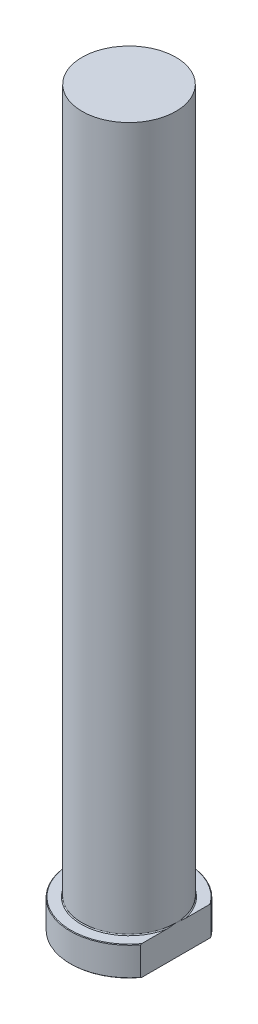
ISO-10303-21;
HEADER;
FILE_DESCRIPTION(('STEP AP214'),'2;1');
FILE_NAME('part.step','',(''),(''),'','','');
FILE_SCHEMA(('AUTOMOTIVE_DESIGN { 1 0 10303 214 1 1 1 1 }'));
ENDSEC;
DATA;
#1=APPLICATION_CONTEXT('core data for automotive mechanical design processes');
#2=APPLICATION_PROTOCOL_DEFINITION('international standard','automotive_design',2000,#1);
#3=PRODUCT_CONTEXT('',#1,'mechanical');
#4=PRODUCT('Part','Part','',(#3));
#5=PRODUCT_RELATED_PRODUCT_CATEGORY('part','',(#4));
#6=PRODUCT_DEFINITION_FORMATION('','',#4);
#7=PRODUCT_DEFINITION_CONTEXT('part definition',#1,'design');
#8=PRODUCT_DEFINITION('design','',#6,#7);
#9=PRODUCT_DEFINITION_SHAPE('','',#8);
#10=(LENGTH_UNIT() NAMED_UNIT(*) SI_UNIT(.MILLI.,.METRE.));
#11=(NAMED_UNIT(*) PLANE_ANGLE_UNIT() SI_UNIT($,.RADIAN.));
#12=(NAMED_UNIT(*) SI_UNIT($,.STERADIAN.) SOLID_ANGLE_UNIT());
#13=UNCERTAINTY_MEASURE_WITH_UNIT(LENGTH_MEASURE(1.E-05),#10,'distance_accuracy_value','');
#14=(GEOMETRIC_REPRESENTATION_CONTEXT(3) GLOBAL_UNCERTAINTY_ASSIGNED_CONTEXT((#13)) GLOBAL_UNIT_ASSIGNED_CONTEXT((#10,
#11,#12)) REPRESENTATION_CONTEXT('',''));
#15=CARTESIAN_POINT('',(0.,0.,0.));
#16=DIRECTION('',(0.,0.,1.));
#17=DIRECTION('',(1.,0.,0.));
#18=AXIS2_PLACEMENT_3D('',#15,#16,#17);
#19=CARTESIAN_POINT('',(0.,0.,0.));
#20=DIRECTION('',(0.,-1.,0.));
#21=DIRECTION('',(0.,0.,-1.));
#22=AXIS2_PLACEMENT_3D('',#19,#20,#21);
#23=PLANE('',#22);
#24=CARTESIAN_POINT('',(0.,0.,0.));
#25=DIRECTION('',(0.,-1.,0.));
#26=DIRECTION('',(0.,0.,-1.));
#27=AXIS2_PLACEMENT_3D('',#24,#25,#26);
#28=CIRCLE('',#27,19.7999999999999);
#29=CARTESIAN_POINT('',(16.,0.,11.6636186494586));
#30=VERTEX_POINT('',#29);
#31=CARTESIAN_POINT('',(16.,0.,-11.6636186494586));
#32=VERTEX_POINT('',#31);
#33=EDGE_CURVE('E98',#30,#32,#28,.T.);
#34=ORIENTED_EDGE('',*,*,#33,.T.);
#35=DIRECTION('',(0.,0.,1.));
#36=VECTOR('',#35,1.);
#37=CARTESIAN_POINT('',(16.,0.,-12.));
#38=LINE('',#37,#36);
#39=EDGE_CURVE('E83',#32,#30,#38,.T.);
#40=ORIENTED_EDGE('',*,*,#39,.T.);
#41=EDGE_LOOP('',(#34,#40));
#42=FACE_BOUND('',#41,.T.);
#43=ADVANCED_FACE('F32',(#42),#23,.T.);
#44=CARTESIAN_POINT('',(0.,259.958771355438,0.));
#45=DIRECTION('',(0.,1.,0.));
#46=DIRECTION('',(0.,0.,1.));
#47=AXIS2_PLACEMENT_3D('',#44,#45,#46);
#48=CYLINDRICAL_SURFACE('',#47,20.);
#49=CARTESIAN_POINT('',(0.,9.79999999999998,0.));
#50=DIRECTION('',(0.,1.,0.));
#51=DIRECTION('',(0.,0.,1.));
#52=AXIS2_PLACEMENT_3D('',#49,#50,#51);
#53=CIRCLE('',#52,20.);
#54=CARTESIAN_POINT('',(16.,9.79999999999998,12.));
#55=VERTEX_POINT('',#54);
#56=CARTESIAN_POINT('',(16.,9.79999999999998,-12.));
#57=VERTEX_POINT('',#56);
#58=EDGE_CURVE('E104',#55,#57,#53,.F.);
#59=ORIENTED_EDGE('',*,*,#58,.T.);
#60=DIRECTION('',(0.,-1.,0.));
#61=VECTOR('',#60,1.);
#62=CARTESIAN_POINT('',(16.,250.,-12.));
#63=LINE('',#62,#61);
#64=CARTESIAN_POINT('',(16.,0.200000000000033,-12.));
#65=VERTEX_POINT('',#64);
#66=EDGE_CURVE('E183',#57,#65,#63,.T.);
#67=ORIENTED_EDGE('',*,*,#66,.T.);
#68=CARTESIAN_POINT('',(0.,0.200000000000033,0.));
#69=DIRECTION('',(0.,-1.,0.));
#70=DIRECTION('',(0.,0.,-1.));
#71=AXIS2_PLACEMENT_3D('',#68,#69,#70);
#72=CIRCLE('',#71,20.);
#73=CARTESIAN_POINT('',(16.,0.200000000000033,12.));
#74=VERTEX_POINT('',#73);
#75=EDGE_CURVE('E100',#65,#74,#72,.F.);
#76=ORIENTED_EDGE('',*,*,#75,.T.);
#77=DIRECTION('',(0.,-1.,0.));
#78=VECTOR('',#77,1.);
#79=CARTESIAN_POINT('',(16.,250.,12.));
#80=LINE('',#79,#78);
#81=EDGE_CURVE('E93',#55,#74,#80,.T.);
#82=ORIENTED_EDGE('',*,*,#81,.F.);
#83=EDGE_LOOP('',(#59,#67,#76,#82));
#84=FACE_BOUND('',#83,.T.);
#85=ADVANCED_FACE('F158',(#84),#48,.T.);
#86=CARTESIAN_POINT('',(-20.,10.,0.));
#87=DIRECTION('',(0.,1.,0.));
#88=DIRECTION('',(0.,0.,1.));
#89=AXIS2_PLACEMENT_3D('',#86,#87,#88);
#90=PLANE('',#89);
#91=CARTESIAN_POINT('',(0.,10.,0.));
#92=DIRECTION('',(0.,1.,0.));
#93=DIRECTION('',(0.,0.,1.));
#94=AXIS2_PLACEMENT_3D('',#91,#92,#93);
#95=CIRCLE('',#94,19.7999999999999);
#96=CARTESIAN_POINT('',(16.,10.,-11.6636186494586));
#97=VERTEX_POINT('',#96);
#98=CARTESIAN_POINT('',(16.,10.,11.6636186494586));
#99=VERTEX_POINT('',#98);
#100=EDGE_CURVE('E178',#97,#99,#95,.T.);
#101=ORIENTED_EDGE('',*,*,#100,.T.);
#102=DIRECTION('',(0.,0.,-1.));
#103=VECTOR('',#102,1.);
#104=CARTESIAN_POINT('',(16.,10.,0.));
#105=LINE('',#104,#103);
#106=CARTESIAN_POINT('',(16.,10.,3.1128764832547));
#107=VERTEX_POINT('',#106);
#108=EDGE_CURVE('E57',#99,#107,#105,.T.);
#109=ORIENTED_EDGE('',*,*,#108,.T.);
#110=CARTESIAN_POINT('',(0.,10.,0.));
#111=DIRECTION('',(0.,1.,0.));
#112=DIRECTION('',(0.,0.,1.));
#113=AXIS2_PLACEMENT_3D('',#110,#111,#112);
#114=CIRCLE('',#113,16.3);
#115=CARTESIAN_POINT('',(16.,10.,-3.11287648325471));
#116=VERTEX_POINT('',#115);
#117=EDGE_CURVE('E107',#107,#116,#114,.F.);
#118=ORIENTED_EDGE('',*,*,#117,.T.);
#119=EDGE_CURVE('E136',#116,#97,#105,.T.);
#120=ORIENTED_EDGE('',*,*,#119,.T.);
#121=EDGE_LOOP('',(#101,#109,#118,#120));
#122=FACE_BOUND('',#121,.T.);
#123=ADVANCED_FACE('F147',(#122),#90,.T.);
#124=CARTESIAN_POINT('',(0.,10.,0.));
#125=DIRECTION('',(0.,-1.,0.));
#126=DIRECTION('',(0.,0.,-1.));
#127=AXIS2_PLACEMENT_3D('',#124,#125,#126);
#128=CONICAL_SURFACE('',#127,19.7999999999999,0.785398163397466);
#129=ORIENTED_EDGE('',*,*,#58,.F.);
#130=CARTESIAN_POINT('',(16.,-1.07064884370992,26.4006999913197));
#131=CARTESIAN_POINT('',(16.,-0.733156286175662,26.0060486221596));
#132=CARTESIAN_POINT('',(16.,-0.39681933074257,25.6104050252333));
#133=CARTESIAN_POINT('',(16.,0.273206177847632,24.8168690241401));
#134=CARTESIAN_POINT('',(16.,0.606894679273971,24.4189765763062));
#135=CARTESIAN_POINT('',(16.,1.2714432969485,23.6204891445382));
#136=CARTESIAN_POINT('',(16.,1.60230187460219,23.2198928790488));
#137=CARTESIAN_POINT('',(16.,2.26059114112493,22.4158945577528));
#138=CARTESIAN_POINT('',(16.,2.58802184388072,22.0124925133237));
#139=CARTESIAN_POINT('',(16.,3.24766747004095,21.1916872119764));
#140=CARTESIAN_POINT('',(16.,3.57977582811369,20.7741982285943));
#141=CARTESIAN_POINT('',(16.,4.23919239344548,19.9354474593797));
#142=CARTESIAN_POINT('',(16.,4.56650063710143,19.5141857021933));
#143=CARTESIAN_POINT('',(16.,5.21544461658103,18.6674666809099));
#144=CARTESIAN_POINT('',(16.,5.53708166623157,18.2420104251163));
#145=CARTESIAN_POINT('',(16.,6.17378218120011,17.3861997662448));
#146=CARTESIAN_POINT('',(16.,6.48884565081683,16.9558453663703));
#147=CARTESIAN_POINT('',(16.,7.11176935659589,16.0887218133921));
#148=CARTESIAN_POINT('',(16.,7.41961501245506,15.6519421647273));
#149=CARTESIAN_POINT('',(16.,8.02597466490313,14.7719292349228));
#150=CARTESIAN_POINT('',(16.,8.32448855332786,14.3286958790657));
#151=CARTESIAN_POINT('',(16.,8.91052998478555,13.4344389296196));
#152=CARTESIAN_POINT('',(16.,9.19804754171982,12.9834087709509));
#153=CARTESIAN_POINT('',(16.,9.75938980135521,12.0728858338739));
#154=CARTESIAN_POINT('',(16.,10.0332147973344,11.6133932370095));
#155=CARTESIAN_POINT('',(16.,10.5615335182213,10.6892898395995));
#156=CARTESIAN_POINT('',(16.,10.816189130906,10.2247720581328));
#157=CARTESIAN_POINT('',(16.,11.3053445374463,9.28510847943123));
#158=CARTESIAN_POINT('',(16.,11.5398419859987,8.80996145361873));
#159=CARTESIAN_POINT('',(16.,11.9836278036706,7.84885100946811));
#160=CARTESIAN_POINT('',(16.,12.1929556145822,7.36290596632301));
#161=CARTESIAN_POINT('',(16.,12.5811435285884,6.37912337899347));
#162=CARTESIAN_POINT('',(16.,12.7600157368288,5.88129064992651));
#163=CARTESIAN_POINT('',(16.,13.0861366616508,4.85753764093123));
#164=CARTESIAN_POINT('',(16.,13.2321910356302,4.33122827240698));
#165=CARTESIAN_POINT('',(16.,13.4164504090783,3.53379728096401));
#166=CARTESIAN_POINT('',(16.,13.4720698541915,3.26663533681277));
#167=CARTESIAN_POINT('',(16.,13.5709016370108,2.7300391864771));
#168=CARTESIAN_POINT('',(16.,13.6141156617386,2.46060529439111));
#169=CARTESIAN_POINT('',(16.,13.6872774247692,1.92117630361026));
#170=CARTESIAN_POINT('',(16.,13.717284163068,1.65118922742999));
#171=CARTESIAN_POINT('',(16.,13.7638048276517,1.11005042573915));
#172=CARTESIAN_POINT('',(16.,13.7803188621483,0.83889870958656));
#173=CARTESIAN_POINT('',(16.,13.7995586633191,0.296109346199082));
#174=CARTESIAN_POINT('',(16.,13.8022847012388,0.024471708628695));
#175=CARTESIAN_POINT('',(16.,13.7939006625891,-0.518588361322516));
#176=CARTESIAN_POINT('',(16.,13.7827905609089,-0.790010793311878));
#177=CARTESIAN_POINT('',(16.,13.7469663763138,-1.33142514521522));
#178=CARTESIAN_POINT('',(16.,13.7222788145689,-1.60141882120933));
#179=CARTESIAN_POINT('',(16.,13.6597540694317,-2.13989179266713));
#180=CARTESIAN_POINT('',(16.,13.6219151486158,-2.40837088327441));
#181=CARTESIAN_POINT('',(16.,13.4895557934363,-3.21066813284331));
#182=CARTESIAN_POINT('',(16.,13.3761851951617,-3.74145456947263));
#183=CARTESIAN_POINT('',(16.,13.1048507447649,-4.79469191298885));
#184=CARTESIAN_POINT('',(16.,12.9466209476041,-5.31707285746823));
#185=CARTESIAN_POINT('',(16.,12.6815624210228,-6.09095035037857));
#186=CARTESIAN_POINT('',(16.,12.5885858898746,-6.34730496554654));
#187=CARTESIAN_POINT('',(16.,12.3942381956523,-6.85681818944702));
#188=CARTESIAN_POINT('',(16.,12.2928668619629,-7.10997673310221));
#189=CARTESIAN_POINT('',(16.,11.9087737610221,-8.0289509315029));
#190=CARTESIAN_POINT('',(16.,11.6032209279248,-8.68528507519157));
#191=CARTESIAN_POINT('',(16.,10.9520387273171,-9.97785473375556));
#192=CARTESIAN_POINT('',(16.,10.6063845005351,-10.6140774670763));
#193=CARTESIAN_POINT('',(16.,9.88410853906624,-11.8704402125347));
#194=CARTESIAN_POINT('',(16.,9.5074202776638,-12.4905417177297));
#195=CARTESIAN_POINT('',(16.,8.73104614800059,-13.7158784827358));
#196=CARTESIAN_POINT('',(16.,8.33136526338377,-14.3211169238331));
#197=CARTESIAN_POINT('',(16.,7.51225576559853,-15.5221520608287));
#198=CARTESIAN_POINT('',(16.,7.09274396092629,-16.1178917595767));
#199=CARTESIAN_POINT('',(16.,6.23957009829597,-17.2991512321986));
#200=CARTESIAN_POINT('',(16.,5.80590743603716,-17.884670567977));
#201=CARTESIAN_POINT('',(16.,4.9278350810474,-19.0464967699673));
#202=CARTESIAN_POINT('',(16.,4.48343853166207,-19.622813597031));
#203=CARTESIAN_POINT('',(16.,3.58557777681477,-20.7683027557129));
#204=CARTESIAN_POINT('',(16.,3.13211380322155,-21.3374752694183));
#205=CARTESIAN_POINT('',(16.,2.3674402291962,-22.2844266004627));
#206=CARTESIAN_POINT('',(16.,2.05826684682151,-22.6638539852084));
#207=CARTESIAN_POINT('',(16.,1.43690833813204,-23.4203229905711));
#208=CARTESIAN_POINT('',(16.,1.12472279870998,-23.7973642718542));
#209=CARTESIAN_POINT('',(16.,0.499956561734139,-24.5465888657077));
#210=CARTESIAN_POINT('',(16.,0.187394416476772,-24.918787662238));
#211=CARTESIAN_POINT('',(16.,-0.439990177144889,-25.6611808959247));
#212=CARTESIAN_POINT('',(16.,-0.754812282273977,-26.031375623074));
#213=CARTESIAN_POINT('',(16.,-1.07064884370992,-26.4006999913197));
#214=B_SPLINE_CURVE_WITH_KNOTS('',3,(#130,#131,#132,#133,#134,#135,#136,#137,#138,#139,#140,
#141,#142,#143,#144,#145,#146,#147,#148,#149,#150,#151,#152,#153,#154,#155,#156,#157,#158,#159,
#160,#161,#162,#163,#164,#165,#166,#167,#168,#169,#170,#171,#172,#173,#174,#175,#176,#177,#178,
#179,#180,#181,#182,#183,#184,#185,#186,#187,#188,#189,#190,#191,#192,#193,#194,#195,#196,#197,
#198,#199,#200,#201,#202,#203,#204,#205,#206,#207,#208,#209,#210,#211,#212,#213),.UNSPECIFIED.,
.F.,.F.,(4,2,2,2,2,2,2,2,2,2,2,2,2,2,2,2,2,2,2,2,2,2,2,2,2,2,2,2,2,2,2,2,2,2,2,2,2,2,2,2,2,4),
(0.,1.55783999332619,3.11571034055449,4.67437978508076,6.23304291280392,7.83343038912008,
9.43380572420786,11.0338053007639,12.6338038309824,14.2367959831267,15.8398067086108,
17.4442401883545,19.0486392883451,20.6374598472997,22.2264650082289,23.8129467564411,
25.398796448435,27.0353648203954,27.853792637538,28.6721091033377,29.4867319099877,
30.3013481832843,31.1159484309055,31.9305501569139,32.7435663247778,33.556689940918,
35.1826128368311,36.8183840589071,37.6363419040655,38.4543163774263,40.6241539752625,
42.7953439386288,44.9713157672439,47.1468177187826,49.3324366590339,51.5181490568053,
53.7013086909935,55.8844125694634,57.3527237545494,58.8212392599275,60.2793254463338,
61.737194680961),.UNSPECIFIED.);
#215=EDGE_CURVE('E135',#55,#99,#214,.T.);
#216=ORIENTED_EDGE('',*,*,#215,.T.);
#217=ORIENTED_EDGE('',*,*,#100,.F.);
#218=EDGE_CURVE('E127',#97,#57,#214,.T.);
#219=ORIENTED_EDGE('',*,*,#218,.T.);
#220=EDGE_LOOP('',(#129,#216,#217,#219));
#221=FACE_BOUND('',#220,.T.);
#222=ADVANCED_FACE('F143',(#221),#128,.T.);
#223=CARTESIAN_POINT('',(0.,0.200000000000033,0.));
#224=DIRECTION('',(0.,1.,0.));
#225=DIRECTION('',(0.,0.,1.));
#226=AXIS2_PLACEMENT_3D('',#223,#224,#225);
#227=CONICAL_SURFACE('',#226,20.,0.785398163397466);
#228=ORIENTED_EDGE('',*,*,#75,.F.);
#229=CARTESIAN_POINT('',(16.,11.0706488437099,-26.4006999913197));
#230=CARTESIAN_POINT('',(16.,10.7331562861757,-26.0060486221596));
#231=CARTESIAN_POINT('',(16.,10.3968193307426,-25.6104050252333));
#232=CARTESIAN_POINT('',(16.,9.72679382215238,-24.8168690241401));
#233=CARTESIAN_POINT('',(16.,9.39310532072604,-24.4189765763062));
#234=CARTESIAN_POINT('',(16.,8.72855670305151,-23.6204891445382));
#235=CARTESIAN_POINT('',(16.,8.39769812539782,-23.2198928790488));
#236=CARTESIAN_POINT('',(16.,7.73940885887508,-22.4158945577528));
#237=CARTESIAN_POINT('',(16.,7.41197815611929,-22.0124925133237));
#238=CARTESIAN_POINT('',(16.,6.75233252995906,-21.1916872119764));
#239=CARTESIAN_POINT('',(16.,6.42022417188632,-20.7741982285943));
#240=CARTESIAN_POINT('',(16.,5.76080760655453,-19.9354474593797));
#241=CARTESIAN_POINT('',(16.,5.43349936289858,-19.5141857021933));
#242=CARTESIAN_POINT('',(16.,4.78455538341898,-18.6674666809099));
#243=CARTESIAN_POINT('',(16.,4.46291833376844,-18.2420104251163));
#244=CARTESIAN_POINT('',(16.,3.8262178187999,-17.3861997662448));
#245=CARTESIAN_POINT('',(16.,3.51115434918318,-16.9558453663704));
#246=CARTESIAN_POINT('',(16.,2.88823064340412,-16.0887218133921));
#247=CARTESIAN_POINT('',(16.,2.58038498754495,-15.6519421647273));
#248=CARTESIAN_POINT('',(16.,1.97402533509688,-14.7719292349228));
#249=CARTESIAN_POINT('',(16.,1.67551144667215,-14.3286958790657));
#250=CARTESIAN_POINT('',(16.,1.08947001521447,-13.4344389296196));
#251=CARTESIAN_POINT('',(16.,0.801952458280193,-12.9834087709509));
#252=CARTESIAN_POINT('',(16.,0.240610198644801,-12.0728858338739));
#253=CARTESIAN_POINT('',(16.,-0.033214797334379,-11.6133932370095));
#254=CARTESIAN_POINT('',(16.,-0.561533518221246,-10.6892898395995));
#255=CARTESIAN_POINT('',(16.,-0.816189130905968,-10.2247720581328));
#256=CARTESIAN_POINT('',(16.,-1.30534453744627,-9.28510847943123));
#257=CARTESIAN_POINT('',(16.,-1.53984198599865,-8.80996145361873));
#258=CARTESIAN_POINT('',(16.,-1.98362780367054,-7.84885100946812));
#259=CARTESIAN_POINT('',(16.,-2.1929556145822,-7.36290596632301));
#260=CARTESIAN_POINT('',(16.,-2.58114352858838,-6.37912337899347));
#261=CARTESIAN_POINT('',(16.,-2.76001573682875,-5.88129064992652));
#262=CARTESIAN_POINT('',(16.,-3.08613666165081,-4.85753764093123));
#263=CARTESIAN_POINT('',(16.,-3.23219103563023,-4.33122827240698));
#264=CARTESIAN_POINT('',(16.,-3.41645040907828,-3.53379728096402));
#265=CARTESIAN_POINT('',(16.,-3.47206985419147,-3.26663533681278));
#266=CARTESIAN_POINT('',(16.,-3.57090163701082,-2.7300391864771));
#267=CARTESIAN_POINT('',(16.,-3.61411566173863,-2.46060529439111));
#268=CARTESIAN_POINT('',(16.,-3.68727742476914,-1.92117630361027));
#269=CARTESIAN_POINT('',(16.,-3.71728416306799,-1.65118922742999));
#270=CARTESIAN_POINT('',(16.,-3.76380482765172,-1.11005042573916));
#271=CARTESIAN_POINT('',(16.,-3.78031886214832,-0.838898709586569));
#272=CARTESIAN_POINT('',(16.,-3.79955866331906,-0.29610934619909));
#273=CARTESIAN_POINT('',(16.,-3.80228470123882,-0.0244717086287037));
#274=CARTESIAN_POINT('',(16.,-3.79390066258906,0.518588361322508));
#275=CARTESIAN_POINT('',(16.,-3.78279056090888,0.790010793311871));
#276=CARTESIAN_POINT('',(16.,-3.74696637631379,1.33142514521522));
#277=CARTESIAN_POINT('',(16.,-3.72227881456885,1.60141882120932));
#278=CARTESIAN_POINT('',(16.,-3.65975406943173,2.13989179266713));
#279=CARTESIAN_POINT('',(16.,-3.62191514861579,2.4083708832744));
#280=CARTESIAN_POINT('',(16.,-3.48955579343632,3.2106681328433));
#281=CARTESIAN_POINT('',(16.,-3.3761851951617,3.74145456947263));
#282=CARTESIAN_POINT('',(16.,-3.1048507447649,4.79469191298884));
#283=CARTESIAN_POINT('',(16.,-2.94662094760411,5.31707285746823));
#284=CARTESIAN_POINT('',(16.,-2.6815624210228,6.09095035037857));
#285=CARTESIAN_POINT('',(16.,-2.58858588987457,6.34730496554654));
#286=CARTESIAN_POINT('',(16.,-2.39423819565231,6.85681818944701));
#287=CARTESIAN_POINT('',(16.,-2.29286686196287,7.10997673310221));
#288=CARTESIAN_POINT('',(16.,-1.90877376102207,8.0289509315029));
#289=CARTESIAN_POINT('',(16.,-1.60322092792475,8.68528507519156));
#290=CARTESIAN_POINT('',(16.,-0.952038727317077,9.97785473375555));
#291=CARTESIAN_POINT('',(16.,-0.606384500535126,10.6140774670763));
#292=CARTESIAN_POINT('',(16.,0.115891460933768,11.8704402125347));
#293=CARTESIAN_POINT('',(16.,0.492579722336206,12.4905417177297));
#294=CARTESIAN_POINT('',(16.,1.26895385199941,13.7158784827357));
#295=CARTESIAN_POINT('',(16.,1.66863473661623,14.3211169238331));
#296=CARTESIAN_POINT('',(16.,2.48774423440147,15.5221520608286));
#297=CARTESIAN_POINT('',(16.,2.90725603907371,16.1178917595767));
#298=CARTESIAN_POINT('',(16.,3.76042990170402,17.2991512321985));
#299=CARTESIAN_POINT('',(16.,4.19409256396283,17.884670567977));
#300=CARTESIAN_POINT('',(16.,5.07216491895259,19.0464967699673));
#301=CARTESIAN_POINT('',(16.,5.51656146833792,19.622813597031));
#302=CARTESIAN_POINT('',(16.,6.41442222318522,20.7683027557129));
#303=CARTESIAN_POINT('',(16.,6.86788619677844,21.3374752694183));
#304=CARTESIAN_POINT('',(16.,7.63255977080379,22.2844266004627));
#305=CARTESIAN_POINT('',(16.,7.94173315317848,22.6638539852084));
#306=CARTESIAN_POINT('',(16.,8.56309166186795,23.4203229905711));
#307=CARTESIAN_POINT('',(16.,8.87527720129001,23.7973642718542));
#308=CARTESIAN_POINT('',(16.,9.50004343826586,24.5465888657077));
#309=CARTESIAN_POINT('',(16.,9.81260558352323,24.918787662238));
#310=CARTESIAN_POINT('',(16.,10.4399901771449,25.6611808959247));
#311=CARTESIAN_POINT('',(16.,10.754812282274,26.031375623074));
#312=CARTESIAN_POINT('',(16.,11.0706488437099,26.4006999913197));
#313=B_SPLINE_CURVE_WITH_KNOTS('',3,(#229,#230,#231,#232,#233,#234,#235,#236,#237,#238,#239,
#240,#241,#242,#243,#244,#245,#246,#247,#248,#249,#250,#251,#252,#253,#254,#255,#256,#257,#258,
#259,#260,#261,#262,#263,#264,#265,#266,#267,#268,#269,#270,#271,#272,#273,#274,#275,#276,#277,
#278,#279,#280,#281,#282,#283,#284,#285,#286,#287,#288,#289,#290,#291,#292,#293,#294,#295,#296,
#297,#298,#299,#300,#301,#302,#303,#304,#305,#306,#307,#308,#309,#310,#311,#312),.UNSPECIFIED.,
.F.,.F.,(4,2,2,2,2,2,2,2,2,2,2,2,2,2,2,2,2,2,2,2,2,2,2,2,2,2,2,2,2,2,2,2,2,2,2,2,2,2,2,2,2,4),
(0.,1.55783999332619,3.11571034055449,4.67437978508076,6.23304291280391,7.83343038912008,
9.43380572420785,11.0338053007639,12.6338038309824,14.2367959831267,15.8398067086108,
17.4442401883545,19.0486392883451,20.6374598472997,22.2264650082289,23.8129467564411,
25.398796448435,27.0353648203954,27.853792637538,28.6721091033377,29.4867319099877,
30.3013481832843,31.1159484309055,31.9305501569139,32.7435663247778,33.556689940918,
35.1826128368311,36.8183840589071,37.6363419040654,38.4543163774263,40.6241539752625,
42.7953439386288,44.9713157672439,47.1468177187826,49.3324366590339,51.5181490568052,
53.7013086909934,55.8844125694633,57.3527237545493,58.8212392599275,60.2793254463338,
61.737194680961),.UNSPECIFIED.);
#314=EDGE_CURVE('E86',#65,#32,#313,.T.);
#315=ORIENTED_EDGE('',*,*,#314,.T.);
#316=ORIENTED_EDGE('',*,*,#33,.F.);
#317=EDGE_CURVE('E89',#30,#74,#313,.T.);
#318=ORIENTED_EDGE('',*,*,#317,.T.);
#319=EDGE_LOOP('',(#228,#315,#316,#318));
#320=FACE_BOUND('',#319,.T.);
#321=ADVANCED_FACE('F97',(#320),#227,.T.);
#322=CARTESIAN_POINT('',(0.,10.3,0.));
#323=DIRECTION('',(0.,1.,0.));
#324=DIRECTION('',(0.,0.,1.));
#325=AXIS2_PLACEMENT_3D('',#322,#323,#324);
#326=TOROIDAL_SURFACE('',#325,16.3,0.3);
#327=CARTESIAN_POINT('',(16.,10.3,0.));
#328=CARTESIAN_POINT('',(16.,10.3000006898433,-5.33715911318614E-09));
#329=CARTESIAN_POINT('',(16.,10.3000013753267,-5.90477996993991E-07));
#330=CARTESIAN_POINT('',(16.,10.3000026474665,-1.99315110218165E-06));
#331=CARTESIAN_POINT('',(16.,10.3000031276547,-2.82387138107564E-06));
#332=CARTESIAN_POINT('',(16.,10.300004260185,-4.93201352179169E-06));
#333=CARTESIAN_POINT('',(16.,10.300004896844,-6.24688723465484E-06));
#334=CARTESIAN_POINT('',(16.,10.3000059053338,-8.79561581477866E-06));
#335=CARTESIAN_POINT('',(16.,10.3000062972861,-1.00244169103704E-05));
#336=CARTESIAN_POINT('',(16.,10.3000079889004,-1.53269558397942E-05));
#337=CARTESIAN_POINT('',(16.,10.3000092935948,-1.94146126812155E-05));
#338=CARTESIAN_POINT('',(16.,10.3000111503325,-2.70530674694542E-05));
#339=CARTESIAN_POINT('',(16.,10.300011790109,-3.05834546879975E-05));
#340=CARTESIAN_POINT('',(16.,10.3000164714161,-5.69924666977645E-05));
#341=CARTESIAN_POINT('',(16.,10.3000199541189,-7.99464318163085E-05));
#342=CARTESIAN_POINT('',(16.,10.3000322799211,-0.000171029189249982));
#343=CARTESIAN_POINT('',(16.,10.3000382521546,-0.000239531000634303));
#344=CARTESIAN_POINT('',(16.,10.3000656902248,-0.00050618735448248));
#345=CARTESIAN_POINT('',(16.,10.3000950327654,-0.0007033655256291));
#346=CARTESIAN_POINT('',(16.,10.3002038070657,-0.0014556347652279));
#347=CARTESIAN_POINT('',(16.,10.300277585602,-0.00201139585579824));
#348=CARTESIAN_POINT('',(16.,10.3005644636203,-0.00414914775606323));
#349=CARTESIAN_POINT('',(16.,10.300783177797,-0.00573048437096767));
#350=CARTESIAN_POINT('',(16.,10.3018172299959,-0.0132287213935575));
#351=CARTESIAN_POINT('',(16.,10.3026243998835,-0.0191465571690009));
#352=CARTESIAN_POINT('',(16.,10.3110865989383,-0.0811528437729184));
#353=CARTESIAN_POINT('',(16.,10.3187815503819,-0.137236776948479));
#354=CARTESIAN_POINT('',(16.,10.3348868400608,-0.255096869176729));
#355=CARTESIAN_POINT('',(16.,10.343290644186,-0.316873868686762));
#356=CARTESIAN_POINT('',(16.,10.3571569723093,-0.419331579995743));
#357=CARTESIAN_POINT('',(16.,10.3626434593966,-0.460008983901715));
#358=CARTESIAN_POINT('',(16.,10.3734224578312,-0.540334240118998));
#359=CARTESIAN_POINT('',(16.,10.3787163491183,-0.579981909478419));
#360=CARTESIAN_POINT('',(16.,10.4083966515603,-0.803619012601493));
#361=CARTESIAN_POINT('',(16.,10.4321379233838,-0.987696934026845));
#362=CARTESIAN_POINT('',(16.,10.4771585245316,-1.35808125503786));
#363=CARTESIAN_POINT('',(16.,10.4984099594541,-1.54439106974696));
#364=CARTESIAN_POINT('',(16.,10.5392977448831,-1.94430528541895));
#365=CARTESIAN_POINT('',(16.,10.5582626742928,-2.15798298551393));
#366=CARTESIAN_POINT('',(16.,10.5798230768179,-2.47853128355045));
#367=CARTESIAN_POINT('',(16.,10.5858566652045,-2.58516682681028));
#368=CARTESIAN_POINT('',(16.,10.5950189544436,-2.79855398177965));
#369=CARTESIAN_POINT('',(16.,10.5981480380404,-2.90530557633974));
#370=CARTESIAN_POINT('',(16.,10.6006064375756,-3.11480969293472));
#371=CARTESIAN_POINT('',(16.,10.600075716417,-3.21755992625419));
#372=CARTESIAN_POINT('',(16.,10.5957602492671,-3.37181907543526));
#373=CARTESIAN_POINT('',(16.,10.593726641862,-3.42337702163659));
#374=CARTESIAN_POINT('',(16.,10.5882429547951,-3.52640582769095));
#375=CARTESIAN_POINT('',(16.,10.584793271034,-3.57787670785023));
#376=CARTESIAN_POINT('',(16.,10.5763123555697,-3.67890194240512));
#377=CARTESIAN_POINT('',(16.,10.5713398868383,-3.72846106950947));
#378=CARTESIAN_POINT('',(16.,10.5593485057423,-3.82738811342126));
#379=CARTESIAN_POINT('',(16.,10.5523274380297,-3.87675577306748));
#380=CARTESIAN_POINT('',(16.,10.5356271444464,-3.97473922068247));
#381=CARTESIAN_POINT('',(16.,10.5259654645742,-4.02335780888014));
#382=CARTESIAN_POINT('',(16.,10.5085240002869,-4.09553189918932));
#383=CARTESIAN_POINT('',(16.,10.5022253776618,-4.11944402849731));
#384=CARTESIAN_POINT('',(16.,10.4883597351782,-4.16689390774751));
#385=CARTESIAN_POINT('',(16.,10.4807934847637,-4.19043187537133));
#386=CARTESIAN_POINT('',(16.,10.468072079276,-4.22548932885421));
#387=CARTESIAN_POINT('',(16.,10.463554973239,-4.23724015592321));
#388=CARTESIAN_POINT('',(16.,10.4539723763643,-4.2605292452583));
#389=CARTESIAN_POINT('',(16.,10.4489064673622,-4.27206733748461));
#390=CARTESIAN_POINT('',(16.,10.4380905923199,-4.29485009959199));
#391=CARTESIAN_POINT('',(16.,10.4323392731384,-4.30609413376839));
#392=CARTESIAN_POINT('',(16.,10.4199753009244,-4.32809262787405));
#393=CARTESIAN_POINT('',(16.,10.4133636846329,-4.33884765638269));
#394=CARTESIAN_POINT('',(16.,10.3989169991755,-4.35969720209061));
#395=CARTESIAN_POINT('',(16.,10.3910687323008,-4.36978269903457));
#396=CARTESIAN_POINT('',(16.,10.3737930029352,-4.38847604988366));
#397=CARTESIAN_POINT('',(16.,10.3643793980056,-4.39709563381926));
#398=CARTESIAN_POINT('',(16.,10.349684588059,-4.40721260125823));
#399=CARTESIAN_POINT('',(16.,10.3452411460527,-4.40991204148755));
#400=CARTESIAN_POINT('',(16.,10.3360120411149,-4.41465735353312));
#401=CARTESIAN_POINT('',(16.,10.331226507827,-4.41670347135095));
#402=CARTESIAN_POINT('',(16.,10.321316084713,-4.41997867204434));
#403=CARTESIAN_POINT('',(16.,10.3161880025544,-4.42119837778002));
#404=CARTESIAN_POINT('',(16.,10.3057936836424,-4.42262740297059));
#405=CARTESIAN_POINT('',(16.,10.3005276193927,-4.42283792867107));
#406=CARTESIAN_POINT('',(16.,10.2906214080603,-4.42225569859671));
#407=CARTESIAN_POINT('',(16.,10.285974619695,-4.42156796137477));
#408=CARTESIAN_POINT('',(16.,10.2768560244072,-4.41944337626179));
#409=CARTESIAN_POINT('',(16.,10.2723843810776,-4.41800584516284));
#410=CARTESIAN_POINT('',(16.,10.2619701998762,-4.41381248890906));
#411=CARTESIAN_POINT('',(16.,10.2561483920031,-4.4107598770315));
#412=CARTESIAN_POINT('',(16.,10.2450526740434,-4.40378684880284));
#413=CARTESIAN_POINT('',(16.,10.239780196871,-4.39986424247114));
#414=CARTESIAN_POINT('',(16.,10.2257729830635,-4.38808908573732));
#415=CARTESIAN_POINT('',(16.,10.2175965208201,-4.37958133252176));
#416=CARTESIAN_POINT('',(16.,10.2024790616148,-4.36154434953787));
#417=CARTESIAN_POINT('',(16.,10.1955419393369,-4.35201206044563));
#418=CARTESIAN_POINT('',(16.,10.1791886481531,-4.32717029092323));
#419=CARTESIAN_POINT('',(16.,10.1703884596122,-4.31145991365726));
#420=CARTESIAN_POINT('',(16.,10.154248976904,-4.2792945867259));
#421=CARTESIAN_POINT('',(16.,10.1469131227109,-4.26283799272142));
#422=CARTESIAN_POINT('',(16.,10.1332947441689,-4.22939871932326));
#423=CARTESIAN_POINT('',(16.,10.1270179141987,-4.2124137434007));
#424=CARTESIAN_POINT('',(16.,10.1153239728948,-4.17817736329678));
#425=CARTESIAN_POINT('',(16.,10.1099058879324,-4.16092628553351));
#426=CARTESIAN_POINT('',(16.,10.0949674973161,-4.10989946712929));
#427=CARTESIAN_POINT('',(16.,10.0863847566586,-4.07584989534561));
#428=CARTESIAN_POINT('',(16.,10.0710343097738,-4.00733871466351));
#429=CARTESIAN_POINT('',(16.,10.0642677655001,-3.97287685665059));
#430=CARTESIAN_POINT('',(16.,10.0460186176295,-3.86898411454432));
#431=CARTESIAN_POINT('',(16.,10.036623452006,-3.79918851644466));
#432=CARTESIAN_POINT('',(16.,10.0215249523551,-3.65915321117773));
#433=CARTESIAN_POINT('',(16.,10.0158261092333,-3.58891306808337));
#434=CARTESIAN_POINT('',(16.,10.0072116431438,-3.44836432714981));
#435=CARTESIAN_POINT('',(16.,10.00429218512,-3.37805595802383));
#436=CARTESIAN_POINT('',(16.,10.000668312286,-3.23904020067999));
#437=CARTESIAN_POINT('',(16.,9.99991350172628,-3.17033397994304));
#438=CARTESIAN_POINT('',(16.,10.0001018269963,-3.03292208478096));
#439=CARTESIAN_POINT('',(16.,10.0010450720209,-2.96421641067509));
#440=CARTESIAN_POINT('',(16.,10.0059904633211,-2.75810886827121));
#441=CARTESIAN_POINT('',(16.,10.0121089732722,-2.62075798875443));
#442=CARTESIAN_POINT('',(16.,10.0284391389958,-2.34612718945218));
#443=CARTESIAN_POINT('',(16.,10.0386564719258,-2.20884763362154));
#444=CARTESIAN_POINT('',(16.,10.0621466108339,-1.93454208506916));
#445=CARTESIAN_POINT('',(16.,10.075419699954,-1.79751611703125));
#446=CARTESIAN_POINT('',(16.,10.118522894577,-1.38740066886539));
#447=CARTESIAN_POINT('',(16.,10.1516806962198,-1.11466812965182));
#448=CARTESIAN_POINT('',(16.,10.2220528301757,-0.569702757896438));
#449=CARTESIAN_POINT('',(16.,10.259267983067,-0.297470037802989));
#450=CARTESIAN_POINT('',(16.,10.2965515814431,-0.0251841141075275));
#451=CARTESIAN_POINT('',(16.,10.2965597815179,-0.0251242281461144));
#452=CARTESIAN_POINT('',(16.,10.2972621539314,-0.019994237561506));
#453=CARTESIAN_POINT('',(16.,10.2979507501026,-0.0149234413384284));
#454=CARTESIAN_POINT('',(16.,10.2989595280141,-0.00761717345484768));
#455=CARTESIAN_POINT('',(16.,10.2992705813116,-0.00538056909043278));
#456=CARTESIAN_POINT('',(16.,10.2996656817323,-0.00242425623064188));
#457=CARTESIAN_POINT('',(16.,10.2997604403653,-0.00170587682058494));
#458=CARTESIAN_POINT('',(16.,10.2998960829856,-0.000765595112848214));
#459=CARTESIAN_POINT('',(16.,10.2999290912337,-0.000542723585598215));
#460=CARTESIAN_POINT('',(16.,10.2999593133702,-0.000246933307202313));
#461=CARTESIAN_POINT('',(16.,10.2999656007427,-0.000175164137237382));
#462=CARTESIAN_POINT('',(16.,10.2999790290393,-8.05668880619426E-05));
#463=CARTESIAN_POINT('',(16.,10.2999827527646,-5.72823548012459E-05));
#464=CARTESIAN_POINT('',(16.,10.2999877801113,-3.05492734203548E-05));
#465=CARTESIAN_POINT('',(16.,10.2999884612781,-2.70084595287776E-05));
#466=CARTESIAN_POINT('',(16.,10.2999904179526,-1.93523012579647E-05));
#467=CARTESIAN_POINT('',(16.,10.2999917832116,-1.52589672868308E-05));
#468=CARTESIAN_POINT('',(16.,10.2999935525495,-9.95362422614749E-06));
#469=CARTESIAN_POINT('',(16.,10.2999939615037,-8.72734435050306E-06));
#470=CARTESIAN_POINT('',(16.,10.2999950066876,-6.18658496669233E-06));
#471=CARTESIAN_POINT('',(16.,10.2999956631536,-4.87748836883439E-06));
#472=CARTESIAN_POINT('',(16.,10.2999968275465,-2.7813010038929E-06));
#473=CARTESIAN_POINT('',(16.,10.2999973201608,-1.95628425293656E-06));
#474=CARTESIAN_POINT('',(16.,10.2999986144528,-5.7037197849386E-07));
#475=CARTESIAN_POINT('',(16.,10.299999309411,5.3429283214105E-09));
#476=CARTESIAN_POINT('',(16.,10.3,0.));
#477=B_SPLINE_CURVE_WITH_KNOTS('',3,(#327,#328,#329,#330,#331,#332,#333,#334,#335,#336,#337,
#338,#339,#340,#341,#342,#343,#344,#345,#346,#347,#348,#349,#350,#351,#352,#353,#354,#355,#356,
#357,#358,#359,#360,#361,#362,#363,#364,#365,#366,#367,#368,#369,#370,#371,#372,#373,#374,#375,
#376,#377,#378,#379,#380,#381,#382,#383,#384,#385,#386,#387,#388,#389,#390,#391,#392,#393,#394,
#395,#396,#397,#398,#399,#400,#401,#402,#403,#404,#405,#406,#407,#408,#409,#410,#411,#412,#413,
#414,#415,#416,#417,#418,#419,#420,#421,#422,#423,#424,#425,#426,#427,#428,#429,#430,#431,#432,
#433,#434,#435,#436,#437,#438,#439,#440,#441,#442,#443,#444,#445,#446,#447,#448,#449,#450,#451,
#452,#453,#454,#455,#456,#457,#458,#459,#460,#461,#462,#463,#464,#465,#466,#467,#468,#469,#470,
#471,#472,#473,#474,#475,#476),.UNSPECIFIED.,.T.,.F.,(4,2,2,2,2,2,2,2,2,2,2,2,2,2,2,2,2,2,2,2,2,
2,2,2,2,2,2,2,2,2,2,2,2,2,2,2,2,2,2,2,2,2,2,2,2,2,2,2,2,2,2,2,2,2,2,2,2,2,2,2,2,2,2,2,2,2,2,2,2,
2,2,2,2,2,4),(0.,2.26177734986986E-06,5.26667807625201E-06,9.57510831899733E-06,
1.34525317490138E-05,2.62880070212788E-05,3.70424186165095E-05,0.00010669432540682,
0.000312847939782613,0.00091073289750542,0.00259276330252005,0.00738178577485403,
0.0252998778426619,0.195126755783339,0.382165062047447,0.505302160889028,0.625300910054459,
1.18209491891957,1.74462724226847,2.38803172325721,2.7084197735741,3.02876559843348,
3.33693017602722,3.49170918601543,3.64644495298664,3.79583437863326,3.94538154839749,
4.09395822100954,4.16811893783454,4.24223480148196,4.27999202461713,4.31777822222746,
4.35564029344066,4.39345715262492,4.43170898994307,4.4696386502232,4.485195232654,
4.50074595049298,4.51647028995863,4.53217582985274,4.54619960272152,4.56023617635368,
4.5798446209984,4.59950299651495,4.63470321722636,4.67001163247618,4.72389684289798,
4.77790718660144,4.83219927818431,4.88642936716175,4.99169124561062,5.09702030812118,
5.30811846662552,5.51947262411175,5.73053472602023,5.93664148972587,6.14276150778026,
6.55512598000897,6.96806358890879,7.38103947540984,8.20517107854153,9.0294696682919,
9.02965100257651,9.04500321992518,9.05177741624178,9.05395133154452,9.05462709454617,
9.05484306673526,9.05491380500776,9.05492461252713,9.05493751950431,9.05494140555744,
9.05494572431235,9.05494873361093,9.05495099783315),.UNSPECIFIED.);
#478=CARTESIAN_POINT('',(16.,10.3,0.));
#479=VERTEX_POINT('',#478);
#480=EDGE_CURVE('E11',#116,#479,#477,.T.);
#481=ORIENTED_EDGE('',*,*,#480,.F.);
#482=ORIENTED_EDGE('',*,*,#117,.F.);
#483=CARTESIAN_POINT('',(16.,10.3,0.));
#484=CARTESIAN_POINT('',(16.,10.2999993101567,5.33715953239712E-09));
#485=CARTESIAN_POINT('',(16.,10.2999986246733,5.90477997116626E-07));
#486=CARTESIAN_POINT('',(16.,10.2999973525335,1.99315110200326E-06));
#487=CARTESIAN_POINT('',(16.,10.2999968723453,2.82387138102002E-06));
#488=CARTESIAN_POINT('',(16.,10.299995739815,4.93201352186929E-06));
#489=CARTESIAN_POINT('',(16.,10.299995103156,6.24688723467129E-06));
#490=CARTESIAN_POINT('',(16.,10.2999940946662,8.7956158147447E-06));
#491=CARTESIAN_POINT('',(16.,10.2999937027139,1.00244169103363E-05));
#492=CARTESIAN_POINT('',(16.,10.2999920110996,1.53269558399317E-05));
#493=CARTESIAN_POINT('',(16.,10.2999907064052,1.94146126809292E-05));
#494=CARTESIAN_POINT('',(16.,10.2999888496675,2.70530674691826E-05));
#495=CARTESIAN_POINT('',(16.,10.299988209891,3.05834546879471E-05));
#496=CARTESIAN_POINT('',(16.,10.2999835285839,5.69924666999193E-05));
#497=CARTESIAN_POINT('',(16.,10.2999800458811,7.99464318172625E-05));
#498=CARTESIAN_POINT('',(15.9999999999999,10.2999677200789,0.000171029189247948));
#499=CARTESIAN_POINT('',(16.,10.2999617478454,0.000239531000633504));
#500=CARTESIAN_POINT('',(16.,10.2999343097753,0.000506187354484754));
#501=CARTESIAN_POINT('',(16.,10.2999049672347,0.000703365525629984));
#502=CARTESIAN_POINT('',(15.9999999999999,10.2997961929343,0.00145563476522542));
#503=CARTESIAN_POINT('',(16.,10.299722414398,0.00201139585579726));
#504=CARTESIAN_POINT('',(16.,10.2994355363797,0.004149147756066));
#505=CARTESIAN_POINT('',(16.,10.299216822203,0.00573048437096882));
#506=CARTESIAN_POINT('',(15.9999999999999,10.2981827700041,0.0132287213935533));
#507=CARTESIAN_POINT('',(15.9999999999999,10.2973756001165,0.0191465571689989));
#508=CARTESIAN_POINT('',(16.0000000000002,10.2889134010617,0.0811528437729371));
#509=CARTESIAN_POINT('',(16.,10.2812184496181,0.137236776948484));
#510=CARTESIAN_POINT('',(15.9999999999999,10.2651131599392,0.255096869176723));
#511=CARTESIAN_POINT('',(16.,10.256709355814,0.316873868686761));
#512=CARTESIAN_POINT('',(16.,10.2428430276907,0.419331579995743));
#513=CARTESIAN_POINT('',(16.,10.2373565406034,0.460008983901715));
#514=CARTESIAN_POINT('',(16.,10.2265775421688,0.540334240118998));
#515=CARTESIAN_POINT('',(16.,10.2212836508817,0.579981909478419));
#516=CARTESIAN_POINT('',(16.,10.1916033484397,0.803619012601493));
#517=CARTESIAN_POINT('',(16.,10.1678620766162,0.987696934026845));
#518=CARTESIAN_POINT('',(16.,10.1228414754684,1.35808125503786));
#519=CARTESIAN_POINT('',(16.,10.101590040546,1.54439106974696));
#520=CARTESIAN_POINT('',(16.,10.0607022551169,1.94430528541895));
#521=CARTESIAN_POINT('',(16.,10.0417373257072,2.15798298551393));
#522=CARTESIAN_POINT('',(16.,10.0201769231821,2.47853128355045));
#523=CARTESIAN_POINT('',(16.,10.0141433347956,2.58516682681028));
#524=CARTESIAN_POINT('',(16.,10.0049810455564,2.79855398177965));
#525=CARTESIAN_POINT('',(16.,10.0018519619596,2.90530557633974));
#526=CARTESIAN_POINT('',(16.,9.9993935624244,3.11480969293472));
#527=CARTESIAN_POINT('',(16.,9.99992428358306,3.21755992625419));
#528=CARTESIAN_POINT('',(16.,10.0042397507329,3.37181907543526));
#529=CARTESIAN_POINT('',(16.,10.006273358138,3.42337702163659));
#530=CARTESIAN_POINT('',(16.,10.0117570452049,3.52640582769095));
#531=CARTESIAN_POINT('',(16.,10.015206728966,3.57787670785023));
#532=CARTESIAN_POINT('',(16.,10.0236876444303,3.67890194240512));
#533=CARTESIAN_POINT('',(16.,10.0286601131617,3.72846106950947));
#534=CARTESIAN_POINT('',(16.,10.0406514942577,3.82738811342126));
#535=CARTESIAN_POINT('',(16.,10.0476725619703,3.87675577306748));
#536=CARTESIAN_POINT('',(16.,10.0643728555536,3.97473922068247));
#537=CARTESIAN_POINT('',(16.,10.0740345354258,4.02335780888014));
#538=CARTESIAN_POINT('',(16.,10.0914759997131,4.09553189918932));
#539=CARTESIAN_POINT('',(16.,10.0977746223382,4.11944402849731));
#540=CARTESIAN_POINT('',(16.,10.1116402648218,4.16689390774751));
#541=CARTESIAN_POINT('',(16.,10.1192065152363,4.19043187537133));
#542=CARTESIAN_POINT('',(16.,10.1319279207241,4.22548932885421));
#543=CARTESIAN_POINT('',(16.,10.136445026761,4.23724015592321));
#544=CARTESIAN_POINT('',(16.,10.1460276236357,4.2605292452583));
#545=CARTESIAN_POINT('',(16.,10.1510935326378,4.27206733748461));
#546=CARTESIAN_POINT('',(16.,10.1619094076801,4.29485009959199));
#547=CARTESIAN_POINT('',(16.,10.1676607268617,4.30609413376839));
#548=CARTESIAN_POINT('',(16.,10.1800246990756,4.32809262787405));
#549=CARTESIAN_POINT('',(16.,10.1866363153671,4.33884765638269));
#550=CARTESIAN_POINT('',(16.,10.2010830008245,4.35969720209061));
#551=CARTESIAN_POINT('',(16.,10.2089312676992,4.36978269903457));
#552=CARTESIAN_POINT('',(16.,10.2262069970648,4.38847604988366));
#553=CARTESIAN_POINT('',(16.,10.2356206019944,4.39709563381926));
#554=CARTESIAN_POINT('',(16.,10.250315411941,4.40721260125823));
#555=CARTESIAN_POINT('',(16.,10.2547588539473,4.40991204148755));
#556=CARTESIAN_POINT('',(16.,10.2639879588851,4.41465735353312));
#557=CARTESIAN_POINT('',(16.,10.268773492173,4.41670347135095));
#558=CARTESIAN_POINT('',(16.,10.278683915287,4.41997867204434));
#559=CARTESIAN_POINT('',(16.,10.2838119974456,4.42119837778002));
#560=CARTESIAN_POINT('',(16.,10.2942063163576,4.42262740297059));
#561=CARTESIAN_POINT('',(16.,10.2994723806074,4.42283792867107));
#562=CARTESIAN_POINT('',(16.,10.3093785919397,4.42225569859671));
#563=CARTESIAN_POINT('',(16.,10.314025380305,4.42156796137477));
#564=CARTESIAN_POINT('',(16.,10.3231439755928,4.41944337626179));
#565=CARTESIAN_POINT('',(16.,10.3276156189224,4.41800584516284));
#566=CARTESIAN_POINT('',(16.,10.3380298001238,4.41381248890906));
#567=CARTESIAN_POINT('',(16.,10.3438516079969,4.4107598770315));
#568=CARTESIAN_POINT('',(16.,10.3549473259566,4.40378684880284));
#569=CARTESIAN_POINT('',(16.,10.360219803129,4.39986424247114));
#570=CARTESIAN_POINT('',(16.,10.3742270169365,4.38808908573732));
#571=CARTESIAN_POINT('',(16.,10.3824034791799,4.37958133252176));
#572=CARTESIAN_POINT('',(16.,10.3975209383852,4.36154434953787));
#573=CARTESIAN_POINT('',(16.,10.4044580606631,4.35201206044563));
#574=CARTESIAN_POINT('',(16.,10.420811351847,4.32717029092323));
#575=CARTESIAN_POINT('',(16.,10.4296115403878,4.31145991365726));
#576=CARTESIAN_POINT('',(16.,10.445751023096,4.2792945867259));
#577=CARTESIAN_POINT('',(16.,10.4530868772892,4.26283799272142));
#578=CARTESIAN_POINT('',(16.,10.4667052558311,4.22939871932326));
#579=CARTESIAN_POINT('',(16.,10.4729820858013,4.2124137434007));
#580=CARTESIAN_POINT('',(16.,10.4846760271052,4.17817736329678));
#581=CARTESIAN_POINT('',(16.,10.4900941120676,4.16092628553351));
#582=CARTESIAN_POINT('',(16.,10.505032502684,4.10989946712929));
#583=CARTESIAN_POINT('',(16.,10.5136152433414,4.07584989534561));
#584=CARTESIAN_POINT('',(16.,10.5289656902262,4.00733871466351));
#585=CARTESIAN_POINT('',(16.,10.5357322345,3.97287685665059));
#586=CARTESIAN_POINT('',(16.,10.5539813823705,3.86898411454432));
#587=CARTESIAN_POINT('',(16.,10.563376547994,3.79918851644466));
#588=CARTESIAN_POINT('',(16.,10.5784750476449,3.65915321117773));
#589=CARTESIAN_POINT('',(16.,10.5841738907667,3.58891306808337));
#590=CARTESIAN_POINT('',(16.,10.5927883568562,3.44836432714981));
#591=CARTESIAN_POINT('',(16.,10.59570781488,3.37805595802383));
#592=CARTESIAN_POINT('',(16.,10.599331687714,3.23904020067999));
#593=CARTESIAN_POINT('',(16.,10.6000864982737,3.17033397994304));
#594=CARTESIAN_POINT('',(16.,10.5998981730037,3.03292208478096));
#595=CARTESIAN_POINT('',(16.,10.5989549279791,2.96421641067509));
#596=CARTESIAN_POINT('',(16.,10.5940095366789,2.75810886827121));
#597=CARTESIAN_POINT('',(16.,10.5878910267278,2.62075798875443));
#598=CARTESIAN_POINT('',(16.,10.5715608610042,2.34612718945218));
#599=CARTESIAN_POINT('',(16.,10.5613435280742,2.20884763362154));
#600=CARTESIAN_POINT('',(16.,10.5378533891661,1.93454208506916));
#601=CARTESIAN_POINT('',(16.,10.5245803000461,1.79751611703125));
#602=CARTESIAN_POINT('',(16.,10.481477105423,1.38740066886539));
#603=CARTESIAN_POINT('',(16.,10.4483193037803,1.11466812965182));
#604=CARTESIAN_POINT('',(16.,10.3779471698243,0.569702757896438));
#605=CARTESIAN_POINT('',(16.,10.340732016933,0.297470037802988));
#606=CARTESIAN_POINT('',(16.,10.3034484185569,0.0251841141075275));
#607=CARTESIAN_POINT('',(16.,10.3034402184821,0.0251242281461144));
#608=CARTESIAN_POINT('',(16.,10.3027378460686,0.019994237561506));
#609=CARTESIAN_POINT('',(16.,10.3020492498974,0.0149234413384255));
#610=CARTESIAN_POINT('',(16.,10.3010404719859,0.00761717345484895));
#611=CARTESIAN_POINT('',(16.,10.3007294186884,0.00538056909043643));
#612=CARTESIAN_POINT('',(16.,10.3003343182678,0.0024242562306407));
#613=CARTESIAN_POINT('',(16.,10.3002395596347,0.00170587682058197));
#614=CARTESIAN_POINT('',(16.,10.3001039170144,0.000765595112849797));
#615=CARTESIAN_POINT('',(16.,10.3000709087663,0.000542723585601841));
#616=CARTESIAN_POINT('',(16.,10.3000406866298,0.000246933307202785));
#617=CARTESIAN_POINT('',(16.,10.3000343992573,0.000175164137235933));
#618=CARTESIAN_POINT('',(16.,10.3000209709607,8.05668880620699E-05));
#619=CARTESIAN_POINT('',(16.,10.3000172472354,5.72823548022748E-05));
#620=CARTESIAN_POINT('',(16.,10.3000122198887,3.05492734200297E-05));
#621=CARTESIAN_POINT('',(16.,10.3000115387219,2.70084595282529E-05));
#622=CARTESIAN_POINT('',(16.,10.3000095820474,1.93523012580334E-05));
#623=CARTESIAN_POINT('',(16.,10.3000082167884,1.52589672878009E-05));
#624=CARTESIAN_POINT('',(16.,10.3000064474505,9.9536242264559E-06));
#625=CARTESIAN_POINT('',(16.,10.3000060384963,8.7273443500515E-06));
#626=CARTESIAN_POINT('',(16.,10.3000049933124,6.18658496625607E-06));
#627=CARTESIAN_POINT('',(16.,10.3000043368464,4.87748836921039E-06));
#628=CARTESIAN_POINT('',(16.,10.3000031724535,2.78130100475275E-06));
#629=CARTESIAN_POINT('',(16.,10.3000026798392,1.95628425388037E-06));
#630=CARTESIAN_POINT('',(16.,10.3000013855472,5.70371978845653E-07));
#631=CARTESIAN_POINT('',(16.,10.300000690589,-5.34292874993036E-09));
#632=CARTESIAN_POINT('',(16.,10.3,0.));
#633=B_SPLINE_CURVE_WITH_KNOTS('',3,(#483,#484,#485,#486,#487,#488,#489,#490,#491,#492,#493,
#494,#495,#496,#497,#498,#499,#500,#501,#502,#503,#504,#505,#506,#507,#508,#509,#510,#511,#512,
#513,#514,#515,#516,#517,#518,#519,#520,#521,#522,#523,#524,#525,#526,#527,#528,#529,#530,#531,
#532,#533,#534,#535,#536,#537,#538,#539,#540,#541,#542,#543,#544,#545,#546,#547,#548,#549,#550,
#551,#552,#553,#554,#555,#556,#557,#558,#559,#560,#561,#562,#563,#564,#565,#566,#567,#568,#569,
#570,#571,#572,#573,#574,#575,#576,#577,#578,#579,#580,#581,#582,#583,#584,#585,#586,#587,#588,
#589,#590,#591,#592,#593,#594,#595,#596,#597,#598,#599,#600,#601,#602,#603,#604,#605,#606,#607,
#608,#609,#610,#611,#612,#613,#614,#615,#616,#617,#618,#619,#620,#621,#622,#623,#624,#625,#626,
#627,#628,#629,#630,#631,#632),.UNSPECIFIED.,.T.,.F.,(4,2,2,2,2,2,2,2,2,2,2,2,2,2,2,2,2,2,2,2,2,
2,2,2,2,2,2,2,2,2,2,2,2,2,2,2,2,2,2,2,2,2,2,2,2,2,2,2,2,2,2,2,2,2,2,2,2,2,2,2,2,2,2,2,2,2,2,2,2,
2,2,2,2,2,4),(0.,2.26177734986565E-06,5.26667807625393E-06,9.57510831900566E-06,
1.34525317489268E-05,2.62880070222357E-05,3.70424186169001E-05,0.000106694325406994,
0.000312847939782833,0.00091073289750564,0.00259276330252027,0.00738178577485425,
0.0252998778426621,0.195126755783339,0.382165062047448,0.505302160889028,0.625300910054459,
1.18209491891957,1.74462724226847,2.38803172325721,2.7084197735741,3.02876559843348,
3.33693017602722,3.49170918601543,3.64644495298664,3.79583437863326,3.94538154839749,
4.09395822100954,4.16811893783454,4.24223480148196,4.27999202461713,4.31777822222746,
4.35564029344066,4.39345715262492,4.43170898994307,4.4696386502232,4.485195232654,
4.50074595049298,4.51647028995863,4.53217582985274,4.54619960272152,4.56023617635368,
4.5798446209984,4.59950299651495,4.63470321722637,4.67001163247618,4.72389684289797,
4.77790718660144,4.83219927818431,4.88642936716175,4.99169124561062,5.09702030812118,
5.30811846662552,5.51947262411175,5.73053472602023,5.93664148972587,6.14276150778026,
6.55512598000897,6.96806358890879,7.38103947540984,8.20517107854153,9.0294696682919,
9.02965100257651,9.04500321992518,9.05177741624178,9.05395133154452,9.05462709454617,
9.05484306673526,9.05491380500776,9.05492461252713,9.05493751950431,9.05494140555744,
9.05494572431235,9.05494873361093,9.05495099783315),.UNSPECIFIED.);
#634=EDGE_CURVE('E46',#479,#107,#633,.T.);
#635=ORIENTED_EDGE('',*,*,#634,.F.);
#636=CARTESIAN_POINT('',(0.,10.3,0.));
#637=DIRECTION('',(0.,1.,0.));
#638=DIRECTION('',(0.,0.,1.));
#639=AXIS2_PLACEMENT_3D('',#636,#637,#638);
#640=CIRCLE('',#639,16.);
#641=EDGE_CURVE('E103',#479,#479,#640,.T.);
#642=ORIENTED_EDGE('',*,*,#641,.F.);
#643=EDGE_LOOP('',(#481,#482,#635,#642));
#644=FACE_BOUND('',#643,.T.);
#645=ADVANCED_FACE('F34',(#644),#326,.F.);
#646=CARTESIAN_POINT('',(0.,259.958771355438,0.));
#647=DIRECTION('',(0.,1.,0.));
#648=DIRECTION('',(0.,0.,1.));
#649=AXIS2_PLACEMENT_3D('',#646,#647,#648);
#650=CYLINDRICAL_SURFACE('',#649,16.);
#651=ORIENTED_EDGE('',*,*,#641,.T.);
#652=EDGE_LOOP('',(#651));
#653=FACE_BOUND('',#652,.T.);
#654=CARTESIAN_POINT('',(0.,250.,0.));
#655=DIRECTION('',(0.,1.,0.));
#656=DIRECTION('',(0.,0.,1.));
#657=AXIS2_PLACEMENT_3D('',#654,#655,#656);
#658=CIRCLE('',#657,16.);
#659=CARTESIAN_POINT('',(0.,250.,16.));
#660=VERTEX_POINT('',#659);
#661=EDGE_CURVE('E101',#660,#660,#658,.T.);
#662=ORIENTED_EDGE('',*,*,#661,.F.);
#663=EDGE_LOOP('',(#662));
#664=FACE_BOUND('',#663,.T.);
#665=ADVANCED_FACE('F155',(#653,#664),#650,.T.);
#666=CARTESIAN_POINT('',(-16.,250.,0.));
#667=DIRECTION('',(0.,1.,0.));
#668=DIRECTION('',(0.,0.,1.));
#669=AXIS2_PLACEMENT_3D('',#666,#667,#668);
#670=PLANE('',#669);
#671=ORIENTED_EDGE('',*,*,#661,.T.);
#672=EDGE_LOOP('',(#671));
#673=FACE_BOUND('',#672,.T.);
#674=ADVANCED_FACE('F121',(#673),#670,.T.);
#675=CARTESIAN_POINT('',(16.,250.,-12.));
#676=DIRECTION('',(1.,0.,0.));
#677=DIRECTION('',(0.,0.,-1.));
#678=AXIS2_PLACEMENT_3D('',#675,#676,#677);
#679=PLANE('',#678);
#680=ORIENTED_EDGE('',*,*,#66,.F.);
#681=ORIENTED_EDGE('',*,*,#218,.F.);
#682=ORIENTED_EDGE('',*,*,#119,.F.);
#683=ORIENTED_EDGE('',*,*,#480,.T.);
#684=ORIENTED_EDGE('',*,*,#634,.T.);
#685=ORIENTED_EDGE('',*,*,#108,.F.);
#686=ORIENTED_EDGE('',*,*,#215,.F.);
#687=ORIENTED_EDGE('',*,*,#81,.T.);
#688=ORIENTED_EDGE('',*,*,#317,.F.);
#689=ORIENTED_EDGE('',*,*,#39,.F.);
#690=ORIENTED_EDGE('',*,*,#314,.F.);
#691=EDGE_LOOP('',(#680,#681,#682,#683,#684,#685,#686,#687,#688,#689,#690));
#692=FACE_BOUND('',#691,.T.);
#693=ADVANCED_FACE('F85',(#692),#679,.T.);
#694=CLOSED_SHELL('',(#43,#85,#123,#222,#321,#645,#665,#674,#693));
#695=MANIFOLD_SOLID_BREP('B2',#694);
#696=ADVANCED_BREP_SHAPE_REPRESENTATION('',(#18,#695),#14);
#697=SHAPE_DEFINITION_REPRESENTATION(#9,#696);
ENDSEC;
END-ISO-10303-21;
